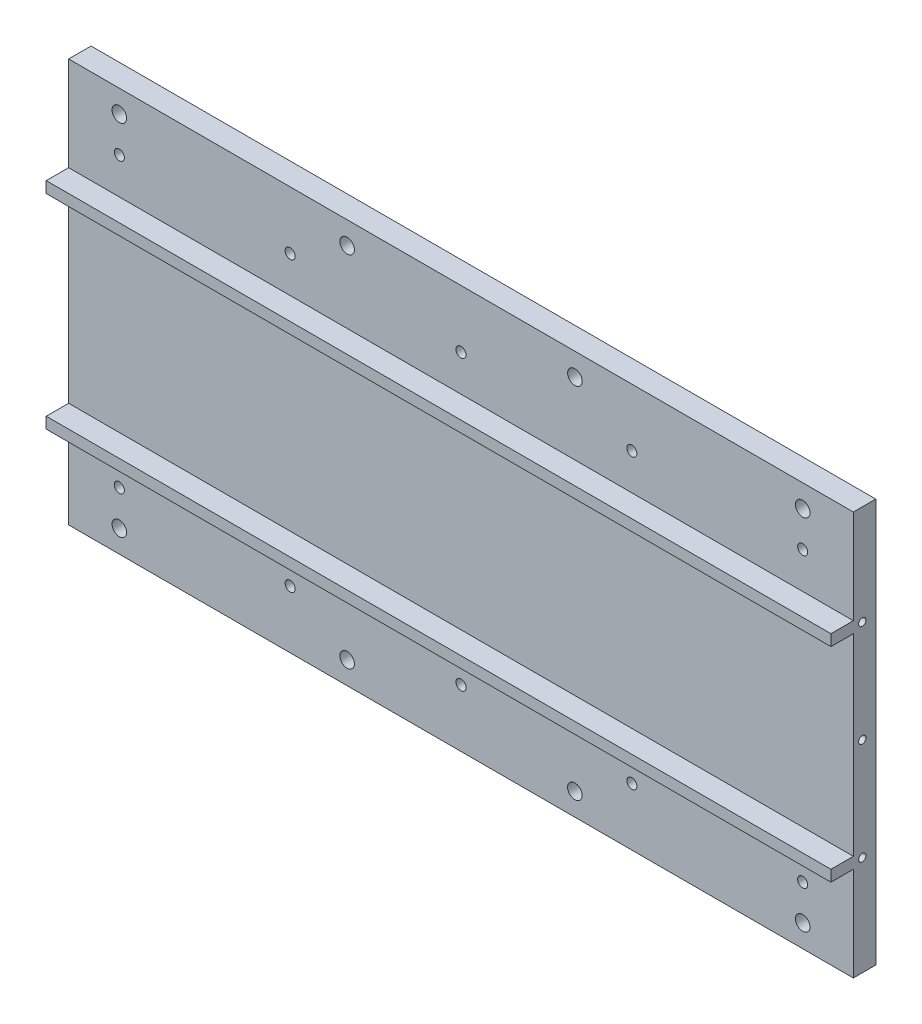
from build123d import *

# Parameters (mm, degrees)
SKETCH1_W                      = 350
SKETCH1_H                      = 180
BOSS_EXTRUDE1_DEPTH            = 10
SKETCH2_W                      = 350
SKETCH2_H                      = 5
BOSS_EXTRUDE2_DEPTH            = 10
F_6_5_6_5_DIAMETER_SLOT1_D     = 6.5
CBORE_FOR_M4_SHCS1_D           = 4.5
CBORE_FOR_M4_SHCS1_CBORE_D     = 8
CBORE_FOR_M4_SHCS1_CBORE_DEPTH = 4.5
LPATTERN1_COUNT                = 4
LPATTERN1_PITCH                = 101.6
LPATTERN2_COUNT                = 5
LPATTERN2_PITCH                = 76.2
MIRROR1_COPY_1_D               = 6.5
MIRROR1_COPY_2_D               = 6.5
MIRROR1_COPY_3_D               = 6.5
MIRROR1_COPY_4_D               = 4.5
MIRROR1_COPY_4_CBORE_D         = 8
MIRROR1_COPY_4_CBORE_DEPTH     = 4.5
MIRROR1_COPY_5_D               = 4.5
MIRROR1_COPY_5_CBORE_D         = 8
MIRROR1_COPY_5_CBORE_DEPTH     = 4.5
MIRROR1_COPY_6_D               = 4.5
MIRROR1_COPY_6_CBORE_D         = 8
MIRROR1_COPY_6_CBORE_DEPTH     = 4.5
MIRROR1_COPY_7_D               = 4.5
MIRROR1_COPY_7_CBORE_D         = 8
MIRROR1_COPY_7_CBORE_DEPTH     = 4.5
LPATTERN3_COUNT                = 2
LPATTERN3_PITCH                = 45.5
LPATTERN3_COL_COUNT            = 2
LPATTERN3_COL_PITCH            = 45.5


with BuildPart() as part:
    # Sketch1 → Boss-Extrude1 (new body)
    with BuildSketch(Plane.XY):
        Rectangle(SKETCH1_W, SKETCH1_H)
    extrude(amount=BOSS_EXTRUDE1_DEPTH)

    # Sketch2 → Boss-Extrude2 (add)
    with BuildSketch(Plane.XY.offset(10)):
        with Locations((0, 45.5)):
            Rectangle(SKETCH2_W, SKETCH2_H)
    boss_extrude2 = extrude(amount=BOSS_EXTRUDE2_DEPTH)

    # 6.5 _6.5_ Diameter Slot1 (through all)
    with Locations(Plane.XY.offset(10)):
        with Locations((152.4, 80)):
            f_6_5_6_5_diameter_slot1 = Hole(F_6_5_6_5_DIAMETER_SLOT1_D / 2)

    # CBORE for M4 SHCS1 (through all)
    with Locations(Plane(origin=(0, 0, 0), x_dir=(-1, 0, 0), z_dir=(0, 0, -1))):
        with Locations((-152.4, 64.25)):
            cbore_for_m4_shcs1 = CounterBoreHole(CBORE_FOR_M4_SHCS1_D / 2, CBORE_FOR_M4_SHCS1_CBORE_D / 2, CBORE_FOR_M4_SHCS1_CBORE_DEPTH)

    # LPattern1: 6.5 _6.5_ Diameter Slot1 ×4
    with Locations(*[(-i * LPATTERN1_PITCH, 0, 0) for i in range(1, LPATTERN1_COUNT)]):
        add(f_6_5_6_5_diameter_slot1, mode=Mode.SUBTRACT)

    # LPattern2: CBORE for M4 SHCS1 ×5
    with Locations(*[(-i * LPATTERN2_PITCH, 0, 0) for i in range(1, LPATTERN2_COUNT)]):
        add(cbore_for_m4_shcs1, mode=Mode.SUBTRACT)

    # Mirror1: Boss-Extrude2, 6.5 _6.5_ Diameter Slot1, CBORE for M4 SHCS1 across plane
    add(boss_extrude2.mirror(Plane.ZX))
    add(f_6_5_6_5_diameter_slot1.mirror(Plane.ZX), mode=Mode.SUBTRACT)
    add(cbore_for_m4_shcs1.mirror(Plane.ZX), mode=Mode.SUBTRACT)

    # Mirror1 copy 1 (through all)
    with Locations(Plane(origin=(-101.6, 0, 10), x_dir=(1, 0, 0), z_dir=(0, 0, 1))):
        with Locations((152.4, -80)):
            Hole(MIRROR1_COPY_1_D / 2)

    # Mirror1 copy 2 (through all)
    with Locations(Plane(origin=(-203.2, 0, 10), x_dir=(1, 0, 0), z_dir=(0, 0, 1))):
        with Locations((152.4, -80)):
            Hole(MIRROR1_COPY_2_D / 2)

    # Mirror1 copy 3 (through all)
    with Locations(Plane(origin=(-304.8, 0, 10), x_dir=(1, 0, 0), z_dir=(0, 0, 1))):
        with Locations((152.4, -80)):
            Hole(MIRROR1_COPY_3_D / 2)

    # Mirror1 copy 4 (through all)
    with Locations(Plane(origin=(-76.2, 0, 0), x_dir=(-1, 0, 0), z_dir=(0, 0, -1))):
        with Locations((-152.4, -64.25)):
            CounterBoreHole(MIRROR1_COPY_4_D / 2, MIRROR1_COPY_4_CBORE_D / 2, MIRROR1_COPY_4_CBORE_DEPTH)

    # Mirror1 copy 5 (through all)
    with Locations(Plane(origin=(-152.4, 0, 0), x_dir=(-1, 0, 0), z_dir=(0, 0, -1))):
        with Locations((-152.4, -64.25)):
            CounterBoreHole(MIRROR1_COPY_5_D / 2, MIRROR1_COPY_5_CBORE_D / 2, MIRROR1_COPY_5_CBORE_DEPTH)

    # Mirror1 copy 6 (through all)
    with Locations(Plane(origin=(-228.6, 0, 0), x_dir=(-1, 0, 0), z_dir=(0, 0, -1))):
        with Locations((-152.4, -64.25)):
            CounterBoreHole(MIRROR1_COPY_6_D / 2, MIRROR1_COPY_6_CBORE_D / 2, MIRROR1_COPY_6_CBORE_DEPTH)

    # Mirror1 copy 7 (through all)
    with Locations(Plane(origin=(-304.8, 0, 0), x_dir=(-1, 0, 0), z_dir=(0, 0, -1))):
        with Locations((-152.4, -64.25)):
            CounterBoreHole(MIRROR1_COPY_7_D / 2, MIRROR1_COPY_7_CBORE_D / 2, MIRROR1_COPY_7_CBORE_DEPTH)

    # Sketch10 → M4x0.7 Tapped Hole1 (revolve, cut)
    with BuildSketch(Plane(origin=(175, 0, 6), x_dir=(0, 0, -1), z_dir=(0, 1, 0))):
        Polygon((0, 0), (0, 12.991420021), (1.65, 12), (1.65, 0), align=None)
    m4x0_7_tapped_hole1 = revolve(axis=Axis((181.35, 0, 6), (-1, 0, 0)), mode=Mode.SUBTRACT)

    # LPattern3: M4x0.7 Tapped Hole1 ×2
    with Locations(*[(0, i * LPATTERN3_PITCH, 0) for i in range(1, LPATTERN3_COUNT)]):
        add(m4x0_7_tapped_hole1, mode=Mode.SUBTRACT)

    # LPattern3 col: M4x0.7 Tapped Hole1 ×2
    with Locations(*[(0, -i * LPATTERN3_COL_PITCH, 0) for i in range(1, LPATTERN3_COL_COUNT)]):
        add(m4x0_7_tapped_hole1, mode=Mode.SUBTRACT)

    # Mirror2: M4x0.7 Tapped Hole1 across plane
    add(m4x0_7_tapped_hole1.mirror(Plane(origin=(0, 0, 0), x_dir=(0, 0, 1), z_dir=(1, 0, 0))), mode=Mode.SUBTRACT)

    # Mirror2 copy 1 sketch → Mirror2 copy 1 (revolve, cut)
    with BuildSketch(Plane(origin=(-175, 45.5, 6), x_dir=(0, 0, -1), z_dir=(0, 1, 0))):
        Polygon((0, 0), (0, -12.991420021), (1.65, -12), (1.65, 0), align=None)
    revolve(axis=Axis((-181.35, 45.5, 6), (-1, 0, 0)), mode=Mode.SUBTRACT)

    # Mirror2 copy 2 sketch → Mirror2 copy 2 (revolve, cut)
    with BuildSketch(Plane(origin=(-175, -45.5, 6), x_dir=(0, 0, -1), z_dir=(0, 1, 0))):
        Polygon((0, 0), (0, -12.991420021), (1.65, -12), (1.65, 0), align=None)
    revolve(axis=Axis((-181.35, -45.5, 6), (-1, 0, 0)), mode=Mode.SUBTRACT)


solid = part.part
